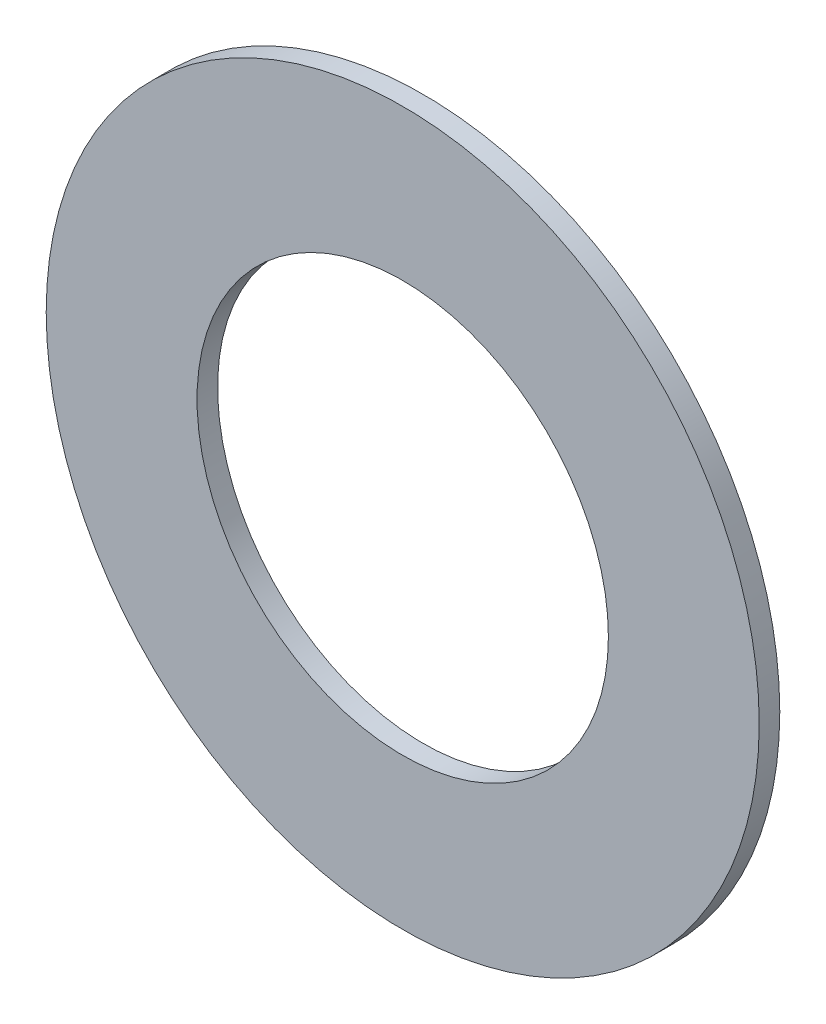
ISO-10303-21;
HEADER;
FILE_DESCRIPTION(('STEP AP214'),'2;1');
FILE_NAME('part.step','',(''),(''),'','','');
FILE_SCHEMA(('AUTOMOTIVE_DESIGN { 1 0 10303 214 1 1 1 1 }'));
ENDSEC;
DATA;
#1=APPLICATION_CONTEXT('core data for automotive mechanical design processes');
#2=APPLICATION_PROTOCOL_DEFINITION('international standard','automotive_design',2000,#1);
#3=PRODUCT_CONTEXT('',#1,'mechanical');
#4=PRODUCT('Part','Part','',(#3));
#5=PRODUCT_RELATED_PRODUCT_CATEGORY('part','',(#4));
#6=PRODUCT_DEFINITION_FORMATION('','',#4);
#7=PRODUCT_DEFINITION_CONTEXT('part definition',#1,'design');
#8=PRODUCT_DEFINITION('design','',#6,#7);
#9=PRODUCT_DEFINITION_SHAPE('','',#8);
#10=(LENGTH_UNIT() NAMED_UNIT(*) SI_UNIT(.MILLI.,.METRE.));
#11=(NAMED_UNIT(*) PLANE_ANGLE_UNIT() SI_UNIT($,.RADIAN.));
#12=(NAMED_UNIT(*) SI_UNIT($,.STERADIAN.) SOLID_ANGLE_UNIT());
#13=UNCERTAINTY_MEASURE_WITH_UNIT(LENGTH_MEASURE(1.E-05),#10,'distance_accuracy_value','');
#14=(GEOMETRIC_REPRESENTATION_CONTEXT(3) GLOBAL_UNCERTAINTY_ASSIGNED_CONTEXT((#13)) GLOBAL_UNIT_ASSIGNED_CONTEXT((#10,
#11,#12)) REPRESENTATION_CONTEXT('',''));
#15=CARTESIAN_POINT('',(0.,0.,0.));
#16=DIRECTION('',(0.,0.,1.));
#17=DIRECTION('',(1.,0.,0.));
#18=AXIS2_PLACEMENT_3D('',#15,#16,#17);
#19=CARTESIAN_POINT('',(0.,0.,1.5));
#20=DIRECTION('',(0.,0.,-1.));
#21=DIRECTION('',(-1.,0.,0.));
#22=AXIS2_PLACEMENT_3D('',#19,#20,#21);
#23=CYLINDRICAL_SURFACE('',#22,26.);
#24=CARTESIAN_POINT('',(0.,0.,1.5));
#25=DIRECTION('',(0.,0.,1.));
#26=DIRECTION('',(1.,0.,0.));
#27=AXIS2_PLACEMENT_3D('',#24,#25,#26);
#28=CIRCLE('',#27,26.);
#29=CARTESIAN_POINT('',(26.,0.,1.5));
#30=VERTEX_POINT('',#29);
#31=EDGE_CURVE('E10',#30,#30,#28,.T.);
#32=ORIENTED_EDGE('',*,*,#31,.F.);
#33=EDGE_LOOP('',(#32));
#34=FACE_BOUND('',#33,.T.);
#35=CARTESIAN_POINT('',(0.,0.,0.));
#36=DIRECTION('',(0.,0.,1.));
#37=DIRECTION('',(1.,0.,0.));
#38=AXIS2_PLACEMENT_3D('',#35,#36,#37);
#39=CIRCLE('',#38,26.);
#40=CARTESIAN_POINT('',(26.,0.,0.));
#41=VERTEX_POINT('',#40);
#42=EDGE_CURVE('E40',#41,#41,#39,.T.);
#43=ORIENTED_EDGE('',*,*,#42,.T.);
#44=EDGE_LOOP('',(#43));
#45=FACE_BOUND('',#44,.T.);
#46=ADVANCED_FACE('F33',(#34,#45),#23,.T.);
#47=CARTESIAN_POINT('',(0.,0.,1.5));
#48=DIRECTION('',(0.,0.,1.));
#49=DIRECTION('',(1.,0.,0.));
#50=AXIS2_PLACEMENT_3D('',#47,#48,#49);
#51=PLANE('',#50);
#52=CARTESIAN_POINT('',(0.,0.,1.5));
#53=DIRECTION('',(0.,0.,1.));
#54=DIRECTION('',(1.,0.,0.));
#55=AXIS2_PLACEMENT_3D('',#52,#53,#54);
#56=CIRCLE('',#55,15.);
#57=CARTESIAN_POINT('',(15.,0.,1.5));
#58=VERTEX_POINT('',#57);
#59=EDGE_CURVE('E46',#58,#58,#56,.T.);
#60=ORIENTED_EDGE('',*,*,#59,.F.);
#61=EDGE_LOOP('',(#60));
#62=FACE_BOUND('',#61,.T.);
#63=ORIENTED_EDGE('',*,*,#31,.T.);
#64=EDGE_LOOP('',(#63));
#65=FACE_BOUND('',#64,.T.);
#66=ADVANCED_FACE('F63',(#62,#65),#51,.T.);
#67=CARTESIAN_POINT('',(0.,0.,0.));
#68=DIRECTION('',(0.,0.,1.));
#69=DIRECTION('',(1.,0.,0.));
#70=AXIS2_PLACEMENT_3D('',#67,#68,#69);
#71=PLANE('',#70);
#72=CARTESIAN_POINT('',(0.,0.,0.));
#73=DIRECTION('',(0.,0.,1.));
#74=DIRECTION('',(1.,0.,0.));
#75=AXIS2_PLACEMENT_3D('',#72,#73,#74);
#76=CIRCLE('',#75,15.);
#77=CARTESIAN_POINT('',(15.,0.,0.));
#78=VERTEX_POINT('',#77);
#79=EDGE_CURVE('E36',#78,#78,#76,.T.);
#80=ORIENTED_EDGE('',*,*,#79,.T.);
#81=EDGE_LOOP('',(#80));
#82=FACE_BOUND('',#81,.T.);
#83=ORIENTED_EDGE('',*,*,#42,.F.);
#84=EDGE_LOOP('',(#83));
#85=FACE_BOUND('',#84,.T.);
#86=ADVANCED_FACE('F53',(#82,#85),#71,.F.);
#87=CARTESIAN_POINT('',(0.,0.,-8.5));
#88=DIRECTION('',(0.,0.,1.));
#89=DIRECTION('',(1.,0.,0.));
#90=AXIS2_PLACEMENT_3D('',#87,#88,#89);
#91=CYLINDRICAL_SURFACE('',#90,15.);
#92=ORIENTED_EDGE('',*,*,#59,.T.);
#93=EDGE_LOOP('',(#92));
#94=FACE_BOUND('',#93,.T.);
#95=ORIENTED_EDGE('',*,*,#79,.F.);
#96=EDGE_LOOP('',(#95));
#97=FACE_BOUND('',#96,.T.);
#98=ADVANCED_FACE('F56',(#94,#97),#91,.F.);
#99=CLOSED_SHELL('',(#46,#66,#86,#98));
#100=MANIFOLD_SOLID_BREP('B2',#99);
#101=ADVANCED_BREP_SHAPE_REPRESENTATION('',(#18,#100),#14);
#102=SHAPE_DEFINITION_REPRESENTATION(#9,#101);
ENDSEC;
END-ISO-10303-21;
